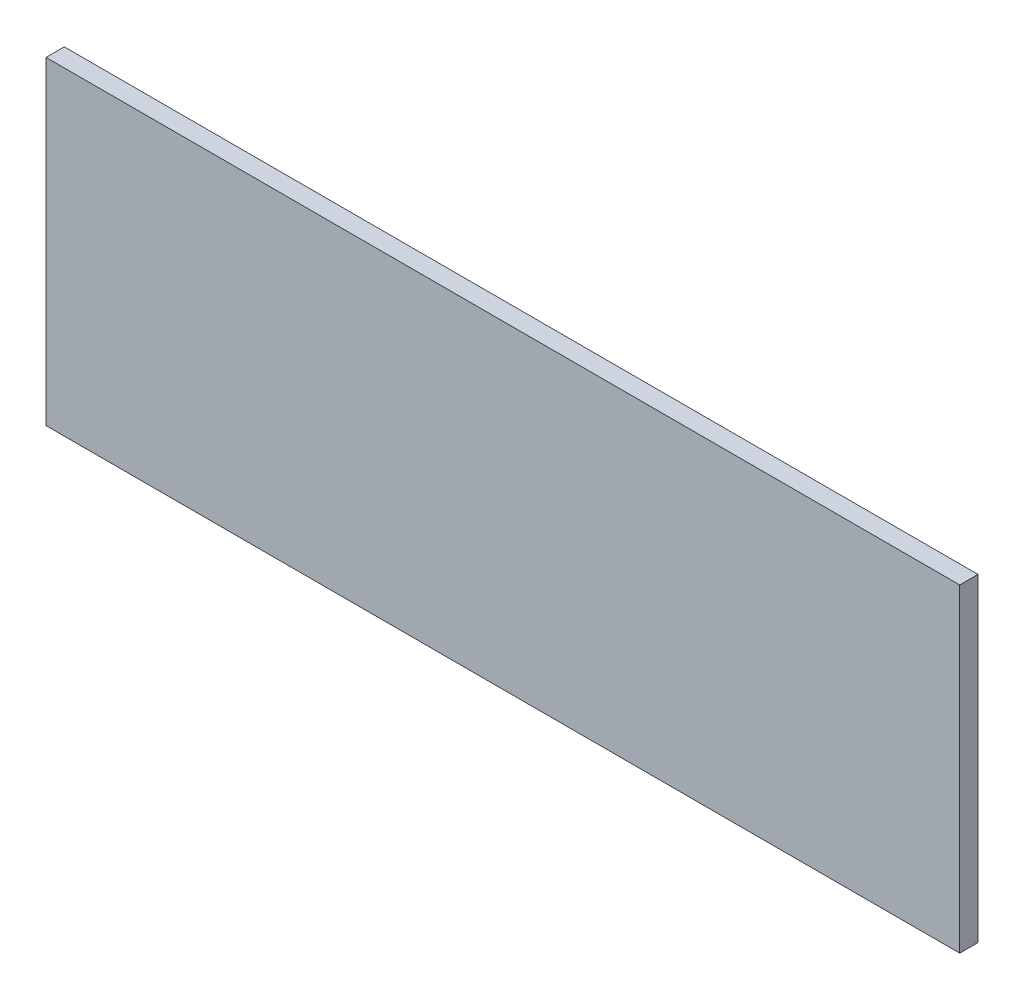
ISO-10303-21;
HEADER;
FILE_DESCRIPTION(('STEP AP214'),'2;1');
FILE_NAME('part.step','',(''),(''),'','','');
FILE_SCHEMA(('AUTOMOTIVE_DESIGN { 1 0 10303 214 1 1 1 1 }'));
ENDSEC;
DATA;
#1=APPLICATION_CONTEXT('core data for automotive mechanical design processes');
#2=APPLICATION_PROTOCOL_DEFINITION('international standard','automotive_design',2000,#1);
#3=PRODUCT_CONTEXT('',#1,'mechanical');
#4=PRODUCT('Part','Part','',(#3));
#5=PRODUCT_RELATED_PRODUCT_CATEGORY('part','',(#4));
#6=PRODUCT_DEFINITION_FORMATION('','',#4);
#7=PRODUCT_DEFINITION_CONTEXT('part definition',#1,'design');
#8=PRODUCT_DEFINITION('design','',#6,#7);
#9=PRODUCT_DEFINITION_SHAPE('','',#8);
#10=(LENGTH_UNIT() NAMED_UNIT(*) SI_UNIT(.MILLI.,.METRE.));
#11=(NAMED_UNIT(*) PLANE_ANGLE_UNIT() SI_UNIT($,.RADIAN.));
#12=(NAMED_UNIT(*) SI_UNIT($,.STERADIAN.) SOLID_ANGLE_UNIT());
#13=UNCERTAINTY_MEASURE_WITH_UNIT(LENGTH_MEASURE(1.E-05),#10,'distance_accuracy_value','');
#14=(GEOMETRIC_REPRESENTATION_CONTEXT(3) GLOBAL_UNCERTAINTY_ASSIGNED_CONTEXT((#13)) GLOBAL_UNIT_ASSIGNED_CONTEXT((#10,
#11,#12)) REPRESENTATION_CONTEXT('',''));
#15=CARTESIAN_POINT('',(0.,0.,0.));
#16=DIRECTION('',(0.,0.,1.));
#17=DIRECTION('',(1.,0.,0.));
#18=AXIS2_PLACEMENT_3D('',#15,#16,#17);
#19=CARTESIAN_POINT('',(-500.,173.639844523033,0.));
#20=DIRECTION('',(-1.,0.,0.));
#21=DIRECTION('',(0.,0.,1.));
#22=AXIS2_PLACEMENT_3D('',#19,#20,#21);
#23=PLANE('',#22);
#24=DIRECTION('',(0.,-1.,0.));
#25=VECTOR('',#24,1.);
#26=CARTESIAN_POINT('',(-500.,173.639844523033,9.99999999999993));
#27=LINE('',#26,#25);
#28=CARTESIAN_POINT('',(-500.,173.639844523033,9.99999999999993));
#29=VERTEX_POINT('',#28);
#30=CARTESIAN_POINT('',(-500.,-0.855604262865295,9.99999999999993));
#31=VERTEX_POINT('',#30);
#32=EDGE_CURVE('E99',#29,#31,#27,.T.);
#33=ORIENTED_EDGE('',*,*,#32,.F.);
#34=DIRECTION('',(0.,0.,1.));
#35=VECTOR('',#34,1.);
#36=CARTESIAN_POINT('',(-500.,173.639844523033,0.));
#37=LINE('',#36,#35);
#38=CARTESIAN_POINT('',(-500.,173.639844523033,0.));
#39=VERTEX_POINT('',#38);
#40=EDGE_CURVE('E11',#39,#29,#37,.T.);
#41=ORIENTED_EDGE('',*,*,#40,.F.);
#42=DIRECTION('',(0.,-1.,0.));
#43=VECTOR('',#42,1.);
#44=CARTESIAN_POINT('',(-500.,173.639844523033,0.));
#45=LINE('',#44,#43);
#46=CARTESIAN_POINT('',(-500.,-0.855604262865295,0.));
#47=VERTEX_POINT('',#46);
#48=EDGE_CURVE('E93',#39,#47,#45,.T.);
#49=ORIENTED_EDGE('',*,*,#48,.T.);
#50=DIRECTION('',(0.,0.,1.));
#51=VECTOR('',#50,1.);
#52=CARTESIAN_POINT('',(-500.,-0.855604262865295,0.));
#53=LINE('',#52,#51);
#54=EDGE_CURVE('E38',#47,#31,#53,.T.);
#55=ORIENTED_EDGE('',*,*,#54,.T.);
#56=EDGE_LOOP('',(#33,#41,#49,#55));
#57=FACE_BOUND('',#56,.T.);
#58=ADVANCED_FACE('F35',(#57),#23,.T.);
#59=CARTESIAN_POINT('',(-500.,173.639844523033,0.));
#60=DIRECTION('',(0.,1.,0.));
#61=DIRECTION('',(0.,0.,1.));
#62=AXIS2_PLACEMENT_3D('',#59,#60,#61);
#63=PLANE('',#62);
#64=DIRECTION('',(-1.,0.,0.));
#65=VECTOR('',#64,1.);
#66=CARTESIAN_POINT('',(-500.,173.639844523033,9.99999999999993));
#67=LINE('',#66,#65);
#68=CARTESIAN_POINT('',(0.,173.639844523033,9.99999999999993));
#69=VERTEX_POINT('',#68);
#70=EDGE_CURVE('E95',#69,#29,#67,.T.);
#71=ORIENTED_EDGE('',*,*,#70,.F.);
#72=DIRECTION('',(0.,0.,1.));
#73=VECTOR('',#72,1.);
#74=CARTESIAN_POINT('',(0.,173.639844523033,0.));
#75=LINE('',#74,#73);
#76=CARTESIAN_POINT('',(0.,173.639844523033,0.));
#77=VERTEX_POINT('',#76);
#78=EDGE_CURVE('E44',#77,#69,#75,.T.);
#79=ORIENTED_EDGE('',*,*,#78,.F.);
#80=DIRECTION('',(-1.,0.,0.));
#81=VECTOR('',#80,1.);
#82=CARTESIAN_POINT('',(-500.,173.639844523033,0.));
#83=LINE('',#82,#81);
#84=EDGE_CURVE('E90',#77,#39,#83,.T.);
#85=ORIENTED_EDGE('',*,*,#84,.T.);
#86=ORIENTED_EDGE('',*,*,#40,.T.);
#87=EDGE_LOOP('',(#71,#79,#85,#86));
#88=FACE_BOUND('',#87,.T.);
#89=ADVANCED_FACE('F109',(#88),#63,.T.);
#90=CARTESIAN_POINT('',(0.,173.639844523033,0.));
#91=DIRECTION('',(1.,0.,0.));
#92=DIRECTION('',(0.,1.,0.));
#93=AXIS2_PLACEMENT_3D('',#90,#91,#92);
#94=PLANE('',#93);
#95=DIRECTION('',(0.,1.,0.));
#96=VECTOR('',#95,1.);
#97=CARTESIAN_POINT('',(0.,173.639844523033,9.99999999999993));
#98=LINE('',#97,#96);
#99=CARTESIAN_POINT('',(0.,-0.855604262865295,9.99999999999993));
#100=VERTEX_POINT('',#99);
#101=EDGE_CURVE('E85',#100,#69,#98,.T.);
#102=ORIENTED_EDGE('',*,*,#101,.F.);
#103=DIRECTION('',(0.,0.,1.));
#104=VECTOR('',#103,1.);
#105=CARTESIAN_POINT('',(0.,-0.855604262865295,0.));
#106=LINE('',#105,#104);
#107=CARTESIAN_POINT('',(0.,-0.855604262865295,0.));
#108=VERTEX_POINT('',#107);
#109=EDGE_CURVE('E80',#108,#100,#106,.T.);
#110=ORIENTED_EDGE('',*,*,#109,.F.);
#111=DIRECTION('',(0.,1.,0.));
#112=VECTOR('',#111,1.);
#113=CARTESIAN_POINT('',(0.,173.639844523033,0.));
#114=LINE('',#113,#112);
#115=EDGE_CURVE('E83',#108,#77,#114,.T.);
#116=ORIENTED_EDGE('',*,*,#115,.T.);
#117=ORIENTED_EDGE('',*,*,#78,.T.);
#118=EDGE_LOOP('',(#102,#110,#116,#117));
#119=FACE_BOUND('',#118,.T.);
#120=ADVANCED_FACE('F82',(#119),#94,.T.);
#121=CARTESIAN_POINT('',(-500.,-0.855604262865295,0.));
#122=DIRECTION('',(0.,-1.,0.));
#123=DIRECTION('',(0.,0.,-1.));
#124=AXIS2_PLACEMENT_3D('',#121,#122,#123);
#125=PLANE('',#124);
#126=DIRECTION('',(1.,0.,0.));
#127=VECTOR('',#126,1.);
#128=CARTESIAN_POINT('',(-500.,-0.855604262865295,9.99999999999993));
#129=LINE('',#128,#127);
#130=EDGE_CURVE('E102',#31,#100,#129,.T.);
#131=ORIENTED_EDGE('',*,*,#130,.F.);
#132=ORIENTED_EDGE('',*,*,#54,.F.);
#133=DIRECTION('',(1.,0.,0.));
#134=VECTOR('',#133,1.);
#135=CARTESIAN_POINT('',(-500.,-0.855604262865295,0.));
#136=LINE('',#135,#134);
#137=EDGE_CURVE('E89',#47,#108,#136,.T.);
#138=ORIENTED_EDGE('',*,*,#137,.T.);
#139=ORIENTED_EDGE('',*,*,#109,.T.);
#140=EDGE_LOOP('',(#131,#132,#138,#139));
#141=FACE_BOUND('',#140,.T.);
#142=ADVANCED_FACE('F92',(#141),#125,.T.);
#143=CARTESIAN_POINT('',(0.,0.,0.));
#144=DIRECTION('',(0.,0.,1.));
#145=DIRECTION('',(1.,0.,0.));
#146=AXIS2_PLACEMENT_3D('',#143,#144,#145);
#147=PLANE('',#146);
#148=ORIENTED_EDGE('',*,*,#48,.F.);
#149=ORIENTED_EDGE('',*,*,#84,.F.);
#150=ORIENTED_EDGE('',*,*,#115,.F.);
#151=ORIENTED_EDGE('',*,*,#137,.F.);
#152=EDGE_LOOP('',(#148,#149,#150,#151));
#153=FACE_BOUND('',#152,.T.);
#154=ADVANCED_FACE('F88',(#153),#147,.F.);
#155=CARTESIAN_POINT('',(0.,0.,9.99999999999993));
#156=DIRECTION('',(0.,0.,1.));
#157=DIRECTION('',(1.,0.,0.));
#158=AXIS2_PLACEMENT_3D('',#155,#156,#157);
#159=PLANE('',#158);
#160=ORIENTED_EDGE('',*,*,#32,.T.);
#161=ORIENTED_EDGE('',*,*,#130,.T.);
#162=ORIENTED_EDGE('',*,*,#101,.T.);
#163=ORIENTED_EDGE('',*,*,#70,.T.);
#164=EDGE_LOOP('',(#160,#161,#162,#163));
#165=FACE_BOUND('',#164,.T.);
#166=ADVANCED_FACE('F108',(#165),#159,.T.);
#167=CLOSED_SHELL('',(#58,#89,#120,#142,#154,#166));
#168=MANIFOLD_SOLID_BREP('B2',#167);
#169=ADVANCED_BREP_SHAPE_REPRESENTATION('',(#18,#168),#14);
#170=SHAPE_DEFINITION_REPRESENTATION(#9,#169);
ENDSEC;
END-ISO-10303-21;
